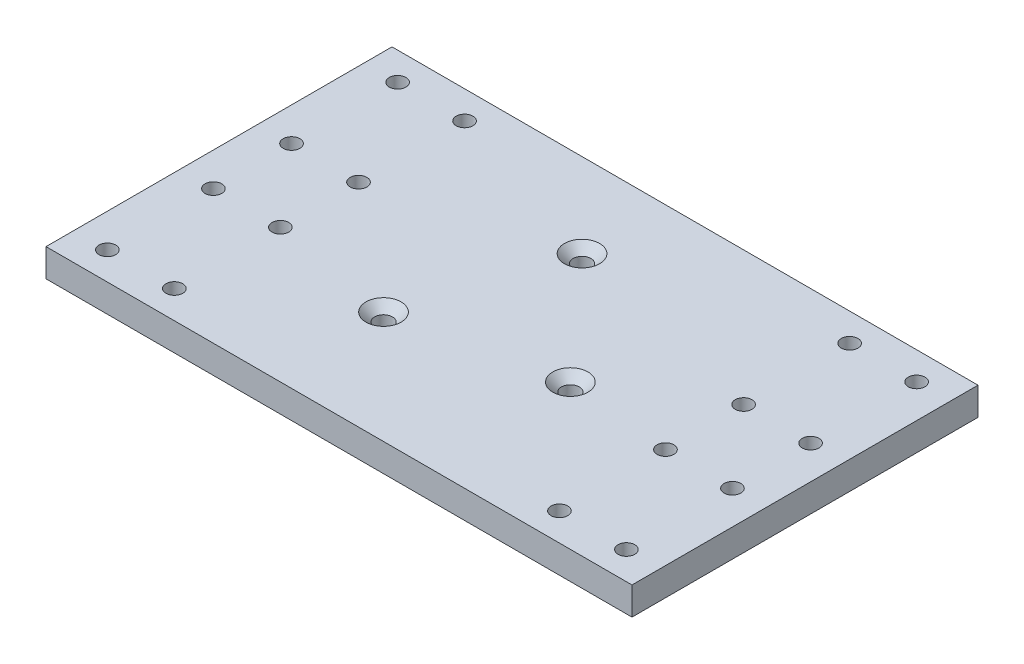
from build123d import *

# Parameters (mm, degrees)
SKETCH1_W                                       = 105
SKETCH1_H                                       = 62
SKETCH1_R                                       = 1.5
BOSS_EXTRUDE1_DEPTH                             = 5
SKETCH4_R                                       = 1.5
CUT_EXTRUDE1_DEPTH                              = 62.173932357
CSK_FOR_M3_FLAT_HEAD_MACHINE_SCREW1_D           = 3.2
CSK_FOR_M3_FLAT_HEAD_MACHINE_SCREW1_DEPTH       = 5.38862301
CSK_FOR_M3_FLAT_HEAD_MACHINE_SCREW1_CSINK_D     = 6.3
CSK_FOR_M3_FLAT_HEAD_MACHINE_SCREW1_CSINK_ANGLE = 90
CSK_FOR_M3_FLAT_HEAD_MACHINE_SCREW1_TIP         = 0.96137699


with BuildPart() as part:
    # Sketch1 → Boss-Extrude1 (new body)
    with BuildSketch(Plane(origin=(0, 0, 0), x_dir=(1, 0, 0), z_dir=(0, 1, 0))):
        Rectangle(SKETCH1_W, SKETCH1_H)
        with Locations(Location((46.5, -26, 0), (0, 0, 270))):
            Circle(SKETCH1_R, mode=Mode.SUBTRACT)
        with Locations(Location((34.5, -26, 0), (0, 0, 270))):
            Circle(SKETCH1_R, mode=Mode.SUBTRACT)
        with Locations(Location((34.5, -7, 0), (0, 0, 270))):
            Circle(SKETCH1_R, mode=Mode.SUBTRACT)
        with Locations(Location((46.5, -7, 0), (0, 0, 270))):
            Circle(SKETCH1_R, mode=Mode.SUBTRACT)
        with Locations(Location((-34.5, -26, 0), (0, 0, 90))):
            Circle(SKETCH1_R, mode=Mode.SUBTRACT)
        with Locations(Location((-46.5, -26, 0), (0, 0, 90))):
            Circle(SKETCH1_R, mode=Mode.SUBTRACT)
        with Locations(Location((-46.5, -7, 0), (0, 0, 90))):
            Circle(SKETCH1_R, mode=Mode.SUBTRACT)
        with Locations(Location((-34.5, -7, 0), (0, 0, 90))):
            Circle(SKETCH1_R, mode=Mode.SUBTRACT)
        with Locations(Location((34.5, 26, 0), (0, 0, 90))):
            Circle(SKETCH1_R, mode=Mode.SUBTRACT)
        with Locations(Location((46.5, 26, 0), (0, 0, 90))):
            Circle(SKETCH1_R, mode=Mode.SUBTRACT)
        with Locations(Location((46.5, 7, 0), (0, 0, 90))):
            Circle(SKETCH1_R, mode=Mode.SUBTRACT)
        with Locations(Location((34.5, 7, 0), (0, 0, 90))):
            Circle(SKETCH1_R, mode=Mode.SUBTRACT)
        with Locations(Location((-34.5, 26, 0), (0, 0, 270))):
            Circle(SKETCH1_R, mode=Mode.SUBTRACT)
        with Locations(Location((-46.5, 26, 0), (0, 0, 270))):
            Circle(SKETCH1_R, mode=Mode.SUBTRACT)
        with Locations(Location((-46.5, 7, 0), (0, 0, 270))):
            Circle(SKETCH1_R, mode=Mode.SUBTRACT)
        with Locations(Location((-34.5, 7, 0), (0, 0, 270))):
            Circle(SKETCH1_R, mode=Mode.SUBTRACT)
    extrude(amount=BOSS_EXTRUDE1_DEPTH)

    # Sketch4 → Cut-Extrude1 (cut, through all)
    with BuildSketch(Plane(origin=(0, 5, 0), x_dir=(1, 0, 0), z_dir=(0, 1, 0))):
        with Locations(Location((-3.39, 15.94, 0), (0, 0, 270))):
            Circle(SKETCH4_R)
        with Locations(Location((-12.11, -10.91, 0), (0, 0, 270))):
            Circle(SKETCH4_R)
        with Locations(Location((15.5, -5.04, 0), (0, 0, 270))):
            Circle(SKETCH4_R)
    extrude(amount=-CUT_EXTRUDE1_DEPTH, mode=Mode.SUBTRACT)

    # CSK for M3 Flat Head Machine Screw1
    with Locations(Plane(origin=(0, 5, 0), x_dir=(1, 0, 0), z_dir=(0, 1, 0))):
        with Locations((-12.11, -10.91), (-3.39, 15.94), (15.5, -5.04)):
            CounterSinkHole(CSK_FOR_M3_FLAT_HEAD_MACHINE_SCREW1_D / 2, CSK_FOR_M3_FLAT_HEAD_MACHINE_SCREW1_CSINK_D / 2, depth=CSK_FOR_M3_FLAT_HEAD_MACHINE_SCREW1_DEPTH, counter_sink_angle=CSK_FOR_M3_FLAT_HEAD_MACHINE_SCREW1_CSINK_ANGLE)
            with Locations((0, 0, -(CSK_FOR_M3_FLAT_HEAD_MACHINE_SCREW1_DEPTH + CSK_FOR_M3_FLAT_HEAD_MACHINE_SCREW1_TIP / 2))):  # 118° drill point
                Cone(0, CSK_FOR_M3_FLAT_HEAD_MACHINE_SCREW1_D / 2, CSK_FOR_M3_FLAT_HEAD_MACHINE_SCREW1_TIP, mode=Mode.SUBTRACT)


solid = part.part
